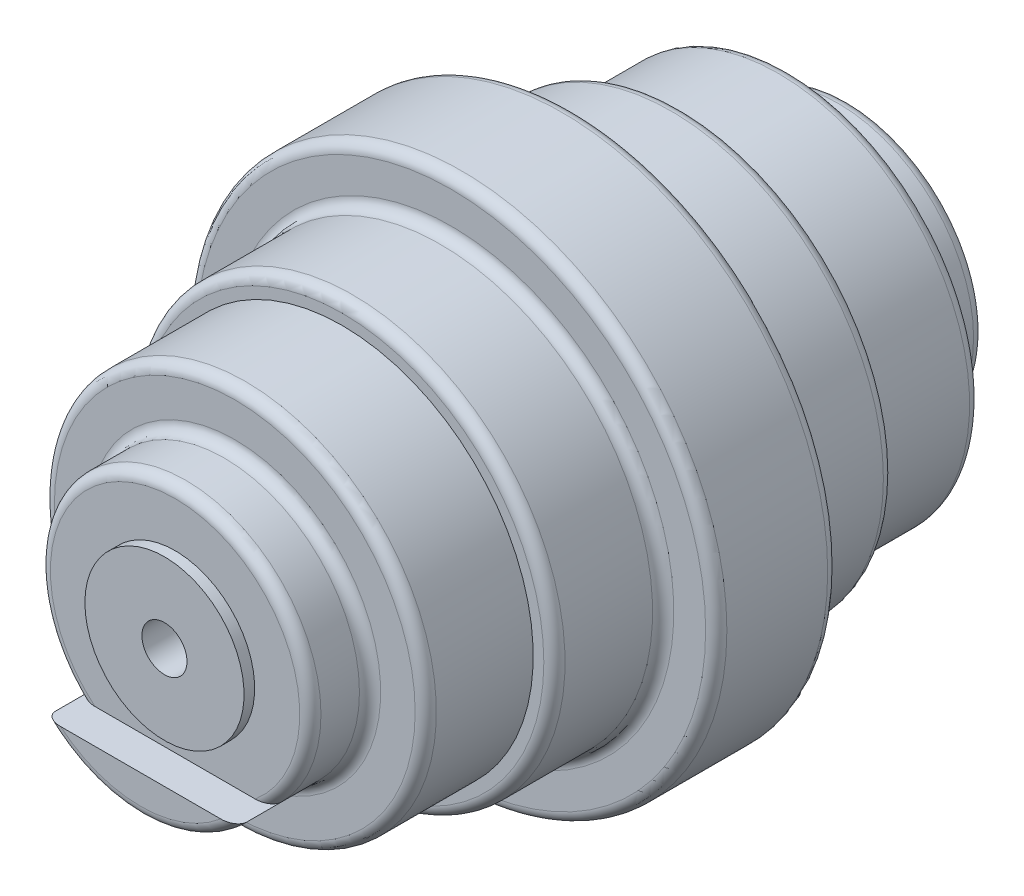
from build123d import *

# Parameters (mm, degrees)
CONG_1_R                = 2
CONG_2_R                = 2
ESQUISSE4_W             = 100
ESQUISSE4_H             = 68
ENL_V_MAT_EXTRU_1_DEPTH = 4.5
ESQUISSE10_R            = 15
ENL_V_MAT_EXTRU_2_DEPTH = 2
CONG_3_R                = 2


with BuildPart() as part:
    # Esquisse1 → R_volution1 (revolve)
    with BuildSketch(Plane(origin=(0, 0, 0), x_dir=(0, 0, -1), z_dir=(1, 0, 0)), mode=Mode.PRIVATE) as r_volution1_sk:
        Polygon((-32, 0), (-32, 40), (-11.5, 40), (-11.5, 50), (11.5, 50), (11.5, 40), (32, 40), (32, 0), align=None)
    revolve(r_volution1_sk.sketch.rotate(Axis((0, 0, 34.749942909), (0, 0, -1)), 90), axis=Axis((0, 0, 34.749942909), (0, 0, -1)))

    # Cong_1
    cong_1_edges = [part.edges().sort_by_distance(p)[0] for p in [
        (-40, 0, -32),
        (-40, 0, -11.5),
        (-50, 0, -11.5),
        (-50, 0, 11.5),
        (-40, 0, 11.5),
        (-40, 0, 32),
    ]]
    fillet(cong_1_edges, radius=CONG_1_R)


with BuildPart() as body_2:
    # Esquisse3 → R_volution2 (revolve)
    with BuildSketch(Plane(origin=(0, 0, 0), x_dir=(0, 0, -1), z_dir=(1, 0, 0)), mode=Mode.PRIVATE) as r_volution2_sk:
        Polygon((32, -36), (52.25, -36), (52.25, -25.5), (70, -25.5), (70, 0), (32, 0), align=None)
    revolve(r_volution2_sk.sketch.rotate(Axis((0, 0, 0), (0, 0, -1)), 90), axis=Axis((0, 0, 0), (0, 0, -1)))

    # Cong_2
    cong_2_edges = [body_2.edges().sort_by_distance(p)[0] for p in [
        (36, 0, -52.25),
        (25.5, 0, -52.25),
        (25.5, 0, -70),
    ]]
    fillet(cong_2_edges, radius=CONG_2_R)

    # Esquisse4 → Enl_v. mat.-Extru.1 (cut)
    with BuildSketch(Plane(origin=(0, 0, -70), x_dir=(-1, 0, 0), z_dir=(0, 0, -1))):
        with Locations((0, 16)):
            Rectangle(ESQUISSE4_W, ESQUISSE4_H)
    extrude(amount=-ENL_V_MAT_EXTRU_1_DEPTH, mode=Mode.SUBTRACT)

    # Esquisse8 → Trou taraud_ M102 (revolve, cut)
    with BuildSketch(Plane(origin=(0, 0, -65.5), x_dir=(0, 1, 0), z_dir=(1, 0, 0))):
        Polygon((0, 0), (0, 26.953738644), (4.25, 24.5), (4.25, 0), align=None)
    revolve(axis=Axis((0, 0, -71.85), (0, 0, 1)), mode=Mode.SUBTRACT)

    # Esquisse10 → Enl_v. mat.-Extru.2 (cut)
    with BuildSketch(Plane(origin=(0, 0, -65.5), x_dir=(-1, 0, 0), z_dir=(0, 0, -1))):
        with BuildLine():
            Line((-18.062391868, -18), (18.062391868, -18))
            ThreePointArc((18.062391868, -18), (0, 25.5), (-18.062391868, -18))
        make_face()
        Circle(ESQUISSE10_R, mode=Mode.SUBTRACT)
    extrude(amount=-ENL_V_MAT_EXTRU_2_DEPTH, mode=Mode.SUBTRACT)

    # Cong_3
    cong_3_edges = [body_2.edges().sort_by_distance(p)[0] for p in [
        (9.73804414, 23.567360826, -63.5),
    ]]
    fillet(cong_3_edges, radius=CONG_3_R)


with BuildPart() as body_3:
    # Sym_trie1: mirrored copy
    add(body_2.part.mirror(Plane.XY))


solid = Compound([part.part, body_2.part, body_3.part])
